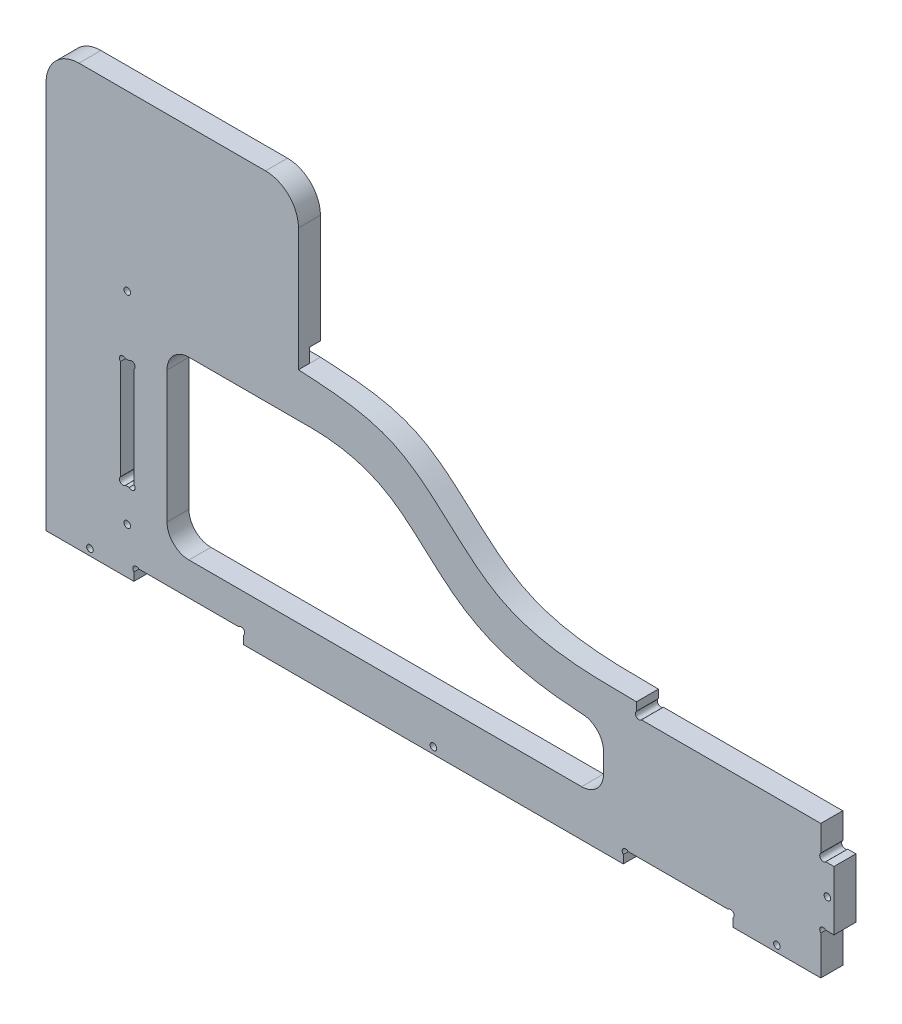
from build123d import *

# Parameters (mm, degrees)
BASE_EXTRUSION_DEPTH    = 10
ESQUISSE2_W             = 115
ESQUISSE2_H             = 6.4
ENL_V_MAT_EXTRU_1_DEPTH = 5
CONG_1_R                = 15
ENL_V_START             = -10
ESQUISSE5_W             = 50
ESQUISSE5_H             = 6
ENL_V_MAT_EXTRU_3_DEPTH = 10
ESQUISSE8_W             = 10
ESQUISSE8_H             = 27
EXTRUSION2_DEPTH        = 6
ESQUISSE9_W             = 6.2
ESQUISSE9_H             = 50
ENL_V_MAT_EXTRU_5_DEPTH = 10
ESQUISSE3_R             = 1.6
ENL_V_MAT_EXTRU_2_DEPTH = 10
ESQUISSE6_R             = 1.5
ENL_V_MAT_EXTRU_4_DEPTH = 10
ESQUISSE10_R            = 1
ENL_V_MAT_EXTRU_6_DEPTH = 5
ENL_V_MAT_EXTRU_7_DEPTH = 319.14925131
CONG_2_R                = 10


with BuildPart() as part:
    # Esquisse1 → Base-Extrusion (new body)
    with BuildSketch(Plane.XY):
        with BuildLine():
            Line((294.761857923, -27.746666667), (210.761857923, -27.746666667))
            Line((210.761857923, -27.746666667), (210.761857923, -21.746666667))
            add(Edge.make_bspline(
                [(210.761857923, -21.746666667), (188.085784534, -21.655154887), (145.071823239, -21.481567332), (108.220083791, 29.468815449), (72.48748918, 31.402384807), (56.761857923, 32.253333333)],
                knots=[0, 0, 0, 0, 0.384342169, 0.729053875, 1, 1, 1, 1], degree=3))
            Line((56.761857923, 32.253333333), (56.761857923, 103.253333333))
            Line((56.761857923, 103.253333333), (-58.238142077, 103.253333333))
            Line((-58.238142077, 103.253333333), (-58.238142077, 32.253333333))
            Line((-58.238142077, 32.253333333), (-58.238142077, -88.746666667))
            Line((-58.238142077, -88.746666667), (294.761857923, -88.746666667))
            Line((294.761857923, -88.746666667), (294.761857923, -27.746666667))
        make_face()
    extrude(amount=BASE_EXTRUSION_DEPTH)

    # Esquisse2 → Enl_v. mat.-Extru.1 (cut)
    with BuildSketch(Plane(origin=(0, 0, 0), x_dir=(-1, 0, 0), z_dir=(0, 0, -1))):
        with Locations((0.738142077, 35.453333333)):
            Rectangle(ESQUISSE2_W, ESQUISSE2_H)
    extrude(amount=-ENL_V_MAT_EXTRU_1_DEPTH, mode=Mode.SUBTRACT)

    # Cong_1
    cong_1_edges = [part.edges().sort_by_distance(p)[0] for p in [
        (-58.238142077, 103.253333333, 5),
        (56.761857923, 103.253333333, 5),
    ]]
    fillet(cong_1_edges, radius=CONG_1_R)

    # Esquisse5 → Enl_v. mat.-Extru.3 (cut)
    with BuildSketch(Plane.XY.offset(10).offset(ENL_V_START)):
        with Locations((229.761857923, -85.746666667)):
            Rectangle(ESQUISSE5_W, ESQUISSE5_H)
        with Locations((6.761857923, -85.746666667)):
            Rectangle(ESQUISSE5_W, ESQUISSE5_H)
    extrude(amount=ENL_V_MAT_EXTRU_3_DEPTH, mode=Mode.SUBTRACT)

    # Esquisse8 → Extrusion2 (add)
    with BuildSketch(Plane(origin=(294.761857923, 0, 0), x_dir=(0, 0, -1), z_dir=(1, 0, 0))):
        with Locations((-5, -55.246666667)):
            Rectangle(ESQUISSE8_W, ESQUISSE8_H)
    extrude(amount=EXTRUSION2_DEPTH)

    # Esquisse9 → Enl_v. mat.-Extru.5 (cut)
    with BuildSketch(Plane.XY.offset(10).offset(ENL_V_START)):
        with Locations((-21.238142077, -27.746666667)):
            Rectangle(ESQUISSE9_W, ESQUISSE9_H)
    extrude(amount=ENL_V_MAT_EXTRU_5_DEPTH, mode=Mode.SUBTRACT)

    # Esquisse3 → Enl_v. mat.-Extru.2 (cut)
    with BuildSketch(Plane.XY.offset(10).offset(ENL_V_START)):
        with Locations((211.861857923, -26.646666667)):
            Circle(ESQUISSE3_R)
        with Locations((253.661857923, -83.846666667)):
            Circle(ESQUISSE3_R)
        with Locations((205.861857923, -83.846666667)):
            Circle(ESQUISSE3_R)
        with Locations((30.661857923, -83.846666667)):
            Circle(ESQUISSE3_R)
        with Locations((-17.138142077, -83.846666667)):
            Circle(ESQUISSE3_R)
        with Locations((-19.238142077, -3.846666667)):
            Circle(ESQUISSE3_R)
        with Locations((295.861857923, -40.646666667)):
            Circle(ESQUISSE3_R)
        with Locations((295.861857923, -69.846666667)):
            Circle(ESQUISSE3_R)
        with Locations((-23.238142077, -3.846666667)):
            Circle(ESQUISSE3_R)
        with Locations((-19.238142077, -51.646666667)):
            Circle(ESQUISSE3_R)
        with Locations((-23.238142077, -51.646666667)):
            Circle(ESQUISSE3_R)
    extrude(amount=ENL_V_MAT_EXTRU_2_DEPTH, mode=Mode.SUBTRACT)

    # Esquisse6 → Enl_v. mat.-Extru.4 (cut)
    with BuildSketch(Plane.XY.offset(10).offset(ENL_V_START)):
        with Locations((-38.238142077, -85.746666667)):
            Circle(ESQUISSE6_R)
        with Locations((118.261857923, -85.746666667)):
            Circle(ESQUISSE6_R)
        with Locations((274.761857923, -85.746666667)):
            Circle(ESQUISSE6_R)
        with Locations((297.761857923, -55.246666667)):
            Circle(ESQUISSE6_R)
        with Locations((-21.238142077, -67.746666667)):
            Circle(ESQUISSE6_R)
        with Locations((-21.238142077, 24.253333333)):
            Circle(ESQUISSE6_R)
    extrude(amount=ENL_V_MAT_EXTRU_4_DEPTH, mode=Mode.SUBTRACT)

    # Esquisse10 → Enl_v. mat.-Extru.6 (cut)
    with BuildSketch(Plane(origin=(0, 0, 0), x_dir=(-1, 0, 0), z_dir=(0, 0, -1))):
        with Locations((-22.261857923, 93.253333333)):
            Circle(ESQUISSE10_R)
        with Locations((23.738142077, 93.253333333)):
            Circle(ESQUISSE10_R)
        with Locations((-22.261857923, 71.253333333)):
            Circle(ESQUISSE10_R)
        with Locations((23.738142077, 71.253333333)):
            Circle(ESQUISSE10_R)
    extrude(amount=-ENL_V_MAT_EXTRU_6_DEPTH, mode=Mode.SUBTRACT)

    # Esquisse11 → Enl_v. mat.-Extru.7 (cut, through all)
    with BuildSketch(Plane.XY.offset(10)):
        with BuildLine():
            Line((-3.138142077, -67.746666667), (195.761857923, -67.746666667))
            Line((195.761857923, -67.746666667), (195.761857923, -39.302951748))
            add(Edge.make_bspline(
                [(57.435526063, 12.253333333), (70.03218257, 12.502108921), (95.773431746, 11.189076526), (135.641869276, -33.759481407), (169.116495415, -38.576435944), (195.761857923, -39.302951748)],
                knots=[0, 0, 0, 0, 0.349213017, 0.58298334, 1, 1, 1, 1], degree=3))
            Line((57.435526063, 12.253333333), (-3.138142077, 12.253333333))
            Line((-3.138142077, 12.253333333), (-3.138142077, -67.746666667))
        make_face()
    extrude(amount=-ENL_V_MAT_EXTRU_7_DEPTH, mode=Mode.SUBTRACT)

    # Cong_2
    cong_2_edges = [part.edges().sort_by_distance(p)[0] for p in [
        (-3.138142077, 12.253333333, 5),
        (-3.138142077, -67.746666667, 5),
        (195.761857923, -67.746666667, 5),
        (195.761857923, -39.302951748, 5),
    ]]
    fillet(cong_2_edges, radius=CONG_2_R)


solid = part.part
